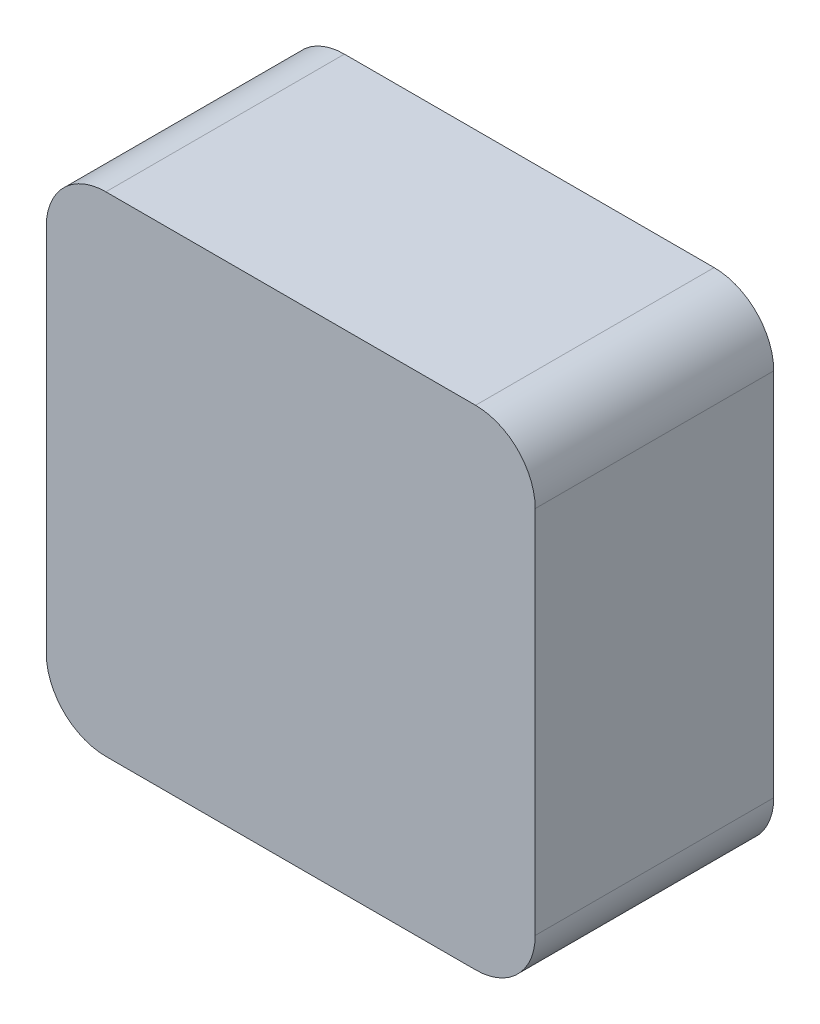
from build123d import *

# Parameters (mm, degrees)
BOSS_EXTRUDE1_DEPTH = 4.000000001


with BuildPart() as part:
    # GENERAL → Boss-Extrude1 (new body)
    with BuildSketch(Plane.XY):
        with BuildLine():
            Line((3.1, 4.099999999), (-3.1, 4.099999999))
            ThreePointArc((-3.1, 4.099999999), (-3.807106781, 3.807106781), (-4.099999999, 3.1))
            Line((-4.099999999, 3.1), (-4.099999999, -3.1))
            ThreePointArc((-4.099999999, -3.1), (-3.807106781, -3.807106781), (-3.1, -4.099999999))
            Line((-3.1, -4.099999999), (3.1, -4.099999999))
            ThreePointArc((3.1, -4.099999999), (3.807106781, -3.807106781), (4.099999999, -3.1))
            Line((4.099999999, -3.1), (4.099999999, 3.1))
            ThreePointArc((4.099999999, 3.1), (3.807106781, 3.807106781), (3.1, 4.099999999))
        make_face()
    extrude(amount=BOSS_EXTRUDE1_DEPTH)


solid = part.part
